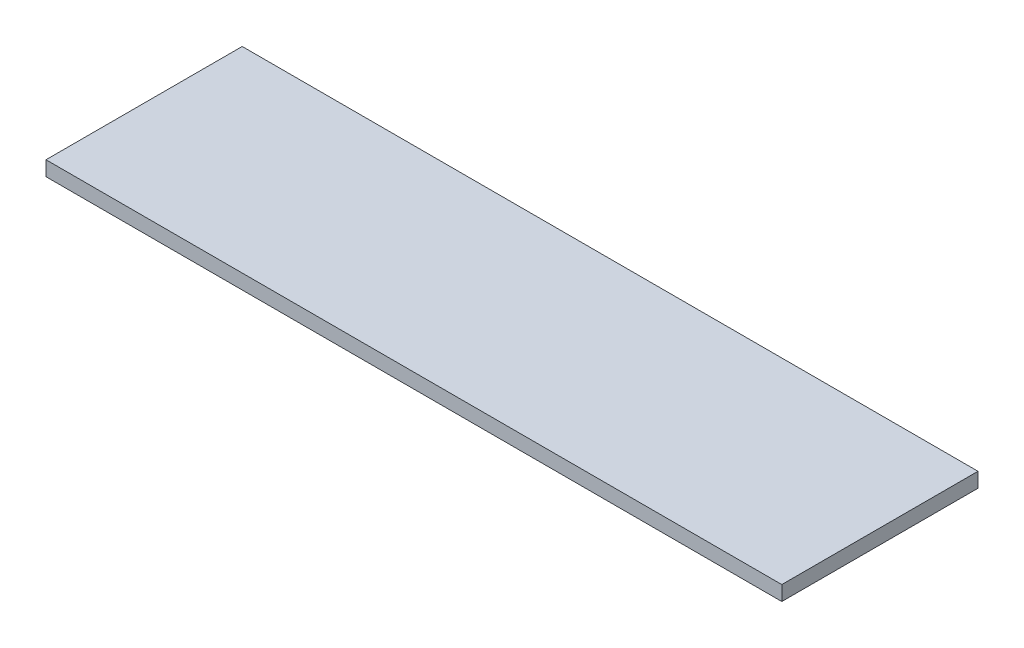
from build123d import *

# Parameters (mm, degrees)
SKETCH1_W           = 150
SKETCH1_H           = 40
BOSS_EXTRUDE1_DEPTH = 3


with BuildPart() as part:
    # Sketch1 → Boss-Extrude1 (new body)
    with BuildSketch(Plane(origin=(0, 0, 0), x_dir=(1, 0, 0), z_dir=(0, 1, 0))):
        Rectangle(SKETCH1_W, SKETCH1_H)
    extrude(amount=BOSS_EXTRUDE1_DEPTH)


solid = part.part
